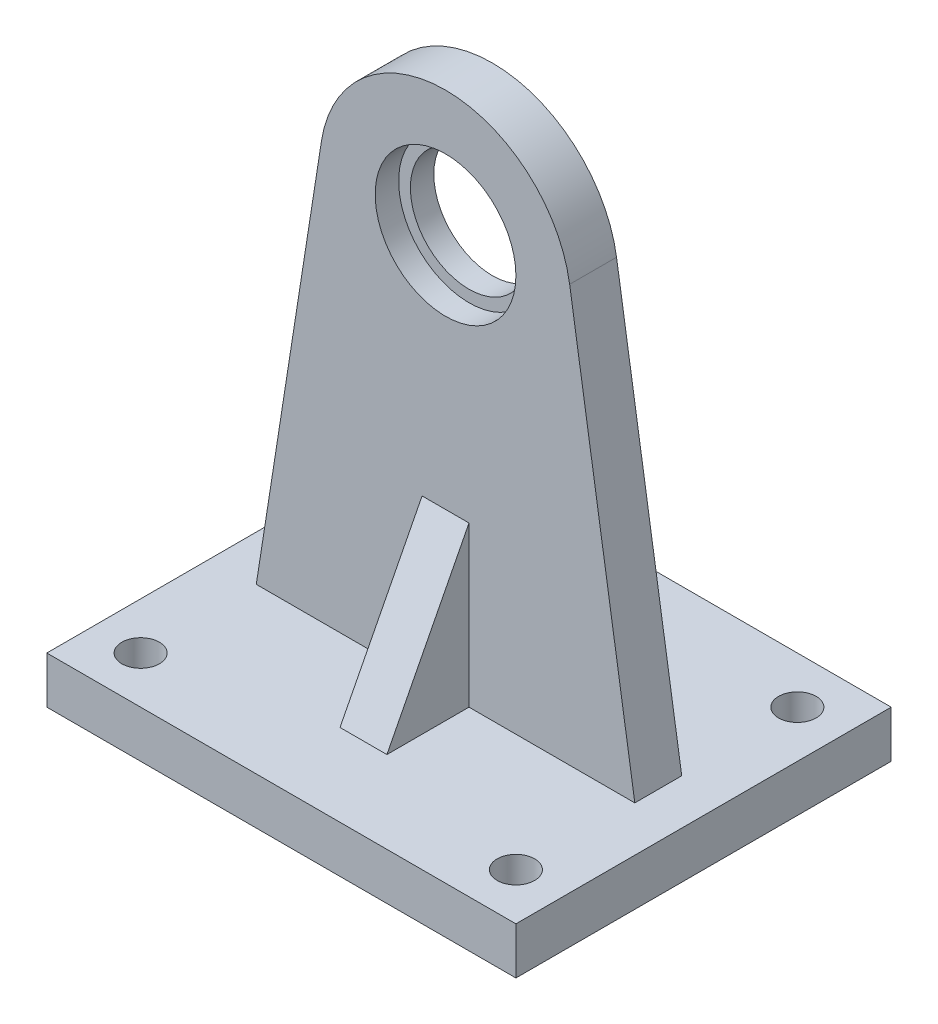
ISO-10303-21;
HEADER;
FILE_DESCRIPTION(('STEP AP214'),'2;1');
FILE_NAME('part.step','',(''),(''),'','','');
FILE_SCHEMA(('AUTOMOTIVE_DESIGN { 1 0 10303 214 1 1 1 1 }'));
ENDSEC;
DATA;
#1=APPLICATION_CONTEXT('core data for automotive mechanical design processes');
#2=APPLICATION_PROTOCOL_DEFINITION('international standard','automotive_design',2000,#1);
#3=PRODUCT_CONTEXT('',#1,'mechanical');
#4=PRODUCT('Part','Part','',(#3));
#5=PRODUCT_RELATED_PRODUCT_CATEGORY('part','',(#4));
#6=PRODUCT_DEFINITION_FORMATION('','',#4);
#7=PRODUCT_DEFINITION_CONTEXT('part definition',#1,'design');
#8=PRODUCT_DEFINITION('design','',#6,#7);
#9=PRODUCT_DEFINITION_SHAPE('','',#8);
#10=(LENGTH_UNIT() NAMED_UNIT(*) SI_UNIT(.MILLI.,.METRE.));
#11=(NAMED_UNIT(*) PLANE_ANGLE_UNIT() SI_UNIT($,.RADIAN.));
#12=(NAMED_UNIT(*) SI_UNIT($,.STERADIAN.) SOLID_ANGLE_UNIT());
#13=UNCERTAINTY_MEASURE_WITH_UNIT(LENGTH_MEASURE(1.E-05),#10,'distance_accuracy_value','');
#14=(GEOMETRIC_REPRESENTATION_CONTEXT(3) GLOBAL_UNCERTAINTY_ASSIGNED_CONTEXT((#13)) GLOBAL_UNIT_ASSIGNED_CONTEXT((#10,
#11,#12)) REPRESENTATION_CONTEXT('',''));
#15=CARTESIAN_POINT('',(0.,0.,0.));
#16=DIRECTION('',(0.,0.,1.));
#17=DIRECTION('',(1.,0.,0.));
#18=AXIS2_PLACEMENT_3D('',#15,#16,#17);
#19=CARTESIAN_POINT('',(-31.75,6.35,25.4));
#20=DIRECTION('',(0.,1.,0.));
#21=DIRECTION('',(0.,0.,1.));
#22=AXIS2_PLACEMENT_3D('',#19,#20,#21);
#23=PLANE('',#22);
#24=CARTESIAN_POINT('',(-25.4,6.35,-19.05));
#25=DIRECTION('',(0.,1.,0.));
#26=DIRECTION('',(0.,0.,-1.));
#27=AXIS2_PLACEMENT_3D('',#24,#25,#26);
#28=CIRCLE('',#27,2.54);
#29=CARTESIAN_POINT('',(-25.4,6.35,-21.59));
#30=VERTEX_POINT('',#29);
#31=EDGE_CURVE('E395',#30,#30,#28,.T.);
#32=ORIENTED_EDGE('',*,*,#31,.F.);
#33=EDGE_LOOP('',(#32));
#34=FACE_BOUND('',#33,.T.);
#35=CARTESIAN_POINT('',(25.4,6.35,-19.05));
#36=DIRECTION('',(0.,1.,0.));
#37=DIRECTION('',(0.,0.,1.));
#38=AXIS2_PLACEMENT_3D('',#35,#36,#37);
#39=CIRCLE('',#38,2.54);
#40=CARTESIAN_POINT('',(25.4,6.35,-16.51));
#41=VERTEX_POINT('',#40);
#42=EDGE_CURVE('E397',#41,#41,#39,.T.);
#43=ORIENTED_EDGE('',*,*,#42,.F.);
#44=EDGE_LOOP('',(#43));
#45=FACE_BOUND('',#44,.T.);
#46=CARTESIAN_POINT('',(25.4,6.35,19.05));
#47=DIRECTION('',(0.,1.,0.));
#48=DIRECTION('',(0.,0.,-1.));
#49=AXIS2_PLACEMENT_3D('',#46,#47,#48);
#50=CIRCLE('',#49,2.54);
#51=CARTESIAN_POINT('',(25.4,6.35,16.51));
#52=VERTEX_POINT('',#51);
#53=EDGE_CURVE('E403',#52,#52,#50,.T.);
#54=ORIENTED_EDGE('',*,*,#53,.F.);
#55=EDGE_LOOP('',(#54));
#56=FACE_BOUND('',#55,.T.);
#57=CARTESIAN_POINT('',(-25.4,6.35,19.05));
#58=DIRECTION('',(0.,1.,0.));
#59=DIRECTION('',(0.,0.,1.));
#60=AXIS2_PLACEMENT_3D('',#57,#58,#59);
#61=CIRCLE('',#60,2.54);
#62=CARTESIAN_POINT('',(-25.4,6.35,21.59));
#63=VERTEX_POINT('',#62);
#64=EDGE_CURVE('E335',#63,#63,#61,.T.);
#65=ORIENTED_EDGE('',*,*,#64,.F.);
#66=EDGE_LOOP('',(#65));
#67=FACE_BOUND('',#66,.T.);
#68=DIRECTION('',(0.,0.,-1.));
#69=VECTOR('',#68,1.);
#70=CARTESIAN_POINT('',(3.175,6.35,14.2875));
#71=LINE('',#70,#69);
#72=CARTESIAN_POINT('',(3.175,6.35,14.2875));
#73=VERTEX_POINT('',#72);
#74=CARTESIAN_POINT('',(3.175,6.35,3.175));
#75=VERTEX_POINT('',#74);
#76=EDGE_CURVE('E46',#73,#75,#71,.T.);
#77=ORIENTED_EDGE('',*,*,#76,.F.);
#78=DIRECTION('',(-1.,0.,0.));
#79=VECTOR('',#78,1.);
#80=CARTESIAN_POINT('',(3.175,6.35,14.2875));
#81=LINE('',#80,#79);
#82=CARTESIAN_POINT('',(-3.175,6.35,14.2875));
#83=VERTEX_POINT('',#82);
#84=EDGE_CURVE('E51',#73,#83,#81,.T.);
#85=ORIENTED_EDGE('',*,*,#84,.T.);
#86=DIRECTION('',(0.,0.,-1.));
#87=VECTOR('',#86,1.);
#88=CARTESIAN_POINT('',(-3.175,6.35,14.2875));
#89=LINE('',#88,#87);
#90=CARTESIAN_POINT('',(-3.175,6.35,3.175));
#91=VERTEX_POINT('',#90);
#92=EDGE_CURVE('E141',#83,#91,#89,.T.);
#93=ORIENTED_EDGE('',*,*,#92,.T.);
#94=DIRECTION('',(1.,0.,0.));
#95=VECTOR('',#94,1.);
#96=CARTESIAN_POINT('',(-25.6206779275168,6.35,3.175));
#97=LINE('',#96,#95);
#98=CARTESIAN_POINT('',(-25.6206779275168,6.35,3.175));
#99=VERTEX_POINT('',#98);
#100=EDGE_CURVE('E188',#99,#91,#97,.T.);
#101=ORIENTED_EDGE('',*,*,#100,.F.);
#102=DIRECTION('',(0.,0.,-1.));
#103=VECTOR('',#102,1.);
#104=CARTESIAN_POINT('',(-25.6206779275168,6.35,3.175));
#105=LINE('',#104,#103);
#106=CARTESIAN_POINT('',(-25.6206779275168,6.35,-3.175));
#107=VERTEX_POINT('',#106);
#108=EDGE_CURVE('E197',#99,#107,#105,.T.);
#109=ORIENTED_EDGE('',*,*,#108,.T.);
#110=DIRECTION('',(1.,0.,0.));
#111=VECTOR('',#110,1.);
#112=CARTESIAN_POINT('',(-25.6206779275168,6.35,-3.175));
#113=LINE('',#112,#111);
#114=CARTESIAN_POINT('',(-3.175,6.35,-3.175));
#115=VERTEX_POINT('',#114);
#116=EDGE_CURVE('E155',#107,#115,#113,.T.);
#117=ORIENTED_EDGE('',*,*,#116,.T.);
#118=CARTESIAN_POINT('',(-3.175,6.35,-14.2875));
#119=VERTEX_POINT('',#118);
#120=EDGE_CURVE('E135',#115,#119,#89,.T.);
#121=ORIENTED_EDGE('',*,*,#120,.T.);
#122=DIRECTION('',(-1.,0.,0.));
#123=VECTOR('',#122,1.);
#124=CARTESIAN_POINT('',(3.175,6.35,-14.2875));
#125=LINE('',#124,#123);
#126=CARTESIAN_POINT('',(3.175,6.35,-14.2875));
#127=VERTEX_POINT('',#126);
#128=EDGE_CURVE('E145',#127,#119,#125,.T.);
#129=ORIENTED_EDGE('',*,*,#128,.F.);
#130=CARTESIAN_POINT('',(3.175,6.35,-3.175));
#131=VERTEX_POINT('',#130);
#132=EDGE_CURVE('E164',#131,#127,#71,.T.);
#133=ORIENTED_EDGE('',*,*,#132,.F.);
#134=CARTESIAN_POINT('',(25.6206779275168,6.35,-3.175));
#135=VERTEX_POINT('',#134);
#136=EDGE_CURVE('E178',#131,#135,#113,.T.);
#137=ORIENTED_EDGE('',*,*,#136,.T.);
#138=DIRECTION('',(0.,0.,-1.));
#139=VECTOR('',#138,1.);
#140=CARTESIAN_POINT('',(25.6206779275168,6.35,3.175));
#141=LINE('',#140,#139);
#142=CARTESIAN_POINT('',(25.6206779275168,6.35,3.175));
#143=VERTEX_POINT('',#142);
#144=EDGE_CURVE('E205',#143,#135,#141,.T.);
#145=ORIENTED_EDGE('',*,*,#144,.F.);
#146=EDGE_CURVE('E187',#75,#143,#97,.T.);
#147=ORIENTED_EDGE('',*,*,#146,.F.);
#148=EDGE_LOOP('',(#77,#85,#93,#101,#109,#117,#121,#129,#133,#137,#145,#147));
#149=FACE_BOUND('',#148,.T.);
#150=DIRECTION('',(0.,0.,1.));
#151=VECTOR('',#150,1.);
#152=CARTESIAN_POINT('',(-31.75,6.35,-25.4));
#153=LINE('',#152,#151);
#154=CARTESIAN_POINT('',(-31.75,6.35,-25.4));
#155=VERTEX_POINT('',#154);
#156=CARTESIAN_POINT('',(-31.75,6.35,25.4));
#157=VERTEX_POINT('',#156);
#158=EDGE_CURVE('E217',#155,#157,#153,.T.);
#159=ORIENTED_EDGE('',*,*,#158,.T.);
#160=DIRECTION('',(1.,0.,0.));
#161=VECTOR('',#160,1.);
#162=CARTESIAN_POINT('',(-31.75,6.35,25.4));
#163=LINE('',#162,#161);
#164=CARTESIAN_POINT('',(31.75,6.35,25.4));
#165=VERTEX_POINT('',#164);
#166=EDGE_CURVE('E220',#157,#165,#163,.T.);
#167=ORIENTED_EDGE('',*,*,#166,.T.);
#168=DIRECTION('',(0.,0.,-1.));
#169=VECTOR('',#168,1.);
#170=CARTESIAN_POINT('',(31.75,6.35,-25.4));
#171=LINE('',#170,#169);
#172=CARTESIAN_POINT('',(31.75,6.35,-25.4));
#173=VERTEX_POINT('',#172);
#174=EDGE_CURVE('E222',#165,#173,#171,.T.);
#175=ORIENTED_EDGE('',*,*,#174,.T.);
#176=DIRECTION('',(-1.,0.,0.));
#177=VECTOR('',#176,1.);
#178=CARTESIAN_POINT('',(-31.75,6.35,-25.4));
#179=LINE('',#178,#177);
#180=EDGE_CURVE('E224',#173,#155,#179,.T.);
#181=ORIENTED_EDGE('',*,*,#180,.T.);
#182=EDGE_LOOP('',(#159,#167,#175,#181));
#183=FACE_BOUND('',#182,.T.);
#184=ADVANCED_FACE('F31',(#34,#45,#56,#67,#149,#183),#23,.T.);
#185=CARTESIAN_POINT('',(-31.75,6.35,-25.4));
#186=DIRECTION('',(1.,0.,0.));
#187=DIRECTION('',(0.,0.,-1.));
#188=AXIS2_PLACEMENT_3D('',#185,#186,#187);
#189=PLANE('',#188);
#190=DIRECTION('',(0.,0.,1.));
#191=VECTOR('',#190,1.);
#192=CARTESIAN_POINT('',(-31.75,0.,-25.4));
#193=LINE('',#192,#191);
#194=CARTESIAN_POINT('',(-31.75,0.,-25.4));
#195=VERTEX_POINT('',#194);
#196=CARTESIAN_POINT('',(-31.75,0.,25.4));
#197=VERTEX_POINT('',#196);
#198=EDGE_CURVE('E208',#195,#197,#193,.T.);
#199=ORIENTED_EDGE('',*,*,#198,.T.);
#200=DIRECTION('',(0.,-1.,0.));
#201=VECTOR('',#200,1.);
#202=CARTESIAN_POINT('',(-31.75,6.35,25.4));
#203=LINE('',#202,#201);
#204=EDGE_CURVE('E235',#157,#197,#203,.T.);
#205=ORIENTED_EDGE('',*,*,#204,.F.);
#206=ORIENTED_EDGE('',*,*,#158,.F.);
#207=DIRECTION('',(0.,-1.,0.));
#208=VECTOR('',#207,1.);
#209=CARTESIAN_POINT('',(-31.75,6.35,-25.4));
#210=LINE('',#209,#208);
#211=EDGE_CURVE('E226',#155,#195,#210,.T.);
#212=ORIENTED_EDGE('',*,*,#211,.T.);
#213=EDGE_LOOP('',(#199,#205,#206,#212));
#214=FACE_BOUND('',#213,.T.);
#215=ADVANCED_FACE('F33',(#214),#189,.F.);
#216=CARTESIAN_POINT('',(-31.75,6.35,25.4));
#217=DIRECTION('',(0.,0.,-1.));
#218=DIRECTION('',(-1.,0.,0.));
#219=AXIS2_PLACEMENT_3D('',#216,#217,#218);
#220=PLANE('',#219);
#221=DIRECTION('',(1.,0.,0.));
#222=VECTOR('',#221,1.);
#223=CARTESIAN_POINT('',(-31.75,0.,25.4));
#224=LINE('',#223,#222);
#225=CARTESIAN_POINT('',(31.75,0.,25.4));
#226=VERTEX_POINT('',#225);
#227=EDGE_CURVE('E211',#197,#226,#224,.T.);
#228=ORIENTED_EDGE('',*,*,#227,.T.);
#229=DIRECTION('',(0.,-1.,0.));
#230=VECTOR('',#229,1.);
#231=CARTESIAN_POINT('',(31.75,6.35,25.4));
#232=LINE('',#231,#230);
#233=EDGE_CURVE('E232',#165,#226,#232,.T.);
#234=ORIENTED_EDGE('',*,*,#233,.F.);
#235=ORIENTED_EDGE('',*,*,#166,.F.);
#236=ORIENTED_EDGE('',*,*,#204,.T.);
#237=EDGE_LOOP('',(#228,#234,#235,#236));
#238=FACE_BOUND('',#237,.T.);
#239=ADVANCED_FACE('F286',(#238),#220,.F.);
#240=CARTESIAN_POINT('',(31.75,6.35,-25.4));
#241=DIRECTION('',(-1.,0.,0.));
#242=DIRECTION('',(0.,0.,1.));
#243=AXIS2_PLACEMENT_3D('',#240,#241,#242);
#244=PLANE('',#243);
#245=DIRECTION('',(0.,0.,-1.));
#246=VECTOR('',#245,1.);
#247=CARTESIAN_POINT('',(31.75,0.,-25.4));
#248=LINE('',#247,#246);
#249=CARTESIAN_POINT('',(31.75,0.,-25.4));
#250=VERTEX_POINT('',#249);
#251=EDGE_CURVE('E213',#226,#250,#248,.T.);
#252=ORIENTED_EDGE('',*,*,#251,.T.);
#253=DIRECTION('',(0.,-1.,0.));
#254=VECTOR('',#253,1.);
#255=CARTESIAN_POINT('',(31.75,6.35,-25.4));
#256=LINE('',#255,#254);
#257=EDGE_CURVE('E229',#173,#250,#256,.T.);
#258=ORIENTED_EDGE('',*,*,#257,.F.);
#259=ORIENTED_EDGE('',*,*,#174,.F.);
#260=ORIENTED_EDGE('',*,*,#233,.T.);
#261=EDGE_LOOP('',(#252,#258,#259,#260));
#262=FACE_BOUND('',#261,.T.);
#263=ADVANCED_FACE('F295',(#262),#244,.F.);
#264=CARTESIAN_POINT('',(-31.75,6.35,-25.4));
#265=DIRECTION('',(0.,0.,1.));
#266=DIRECTION('',(1.,0.,0.));
#267=AXIS2_PLACEMENT_3D('',#264,#265,#266);
#268=PLANE('',#267);
#269=DIRECTION('',(-1.,0.,0.));
#270=VECTOR('',#269,1.);
#271=CARTESIAN_POINT('',(-31.75,0.,-25.4));
#272=LINE('',#271,#270);
#273=EDGE_CURVE('E215',#250,#195,#272,.T.);
#274=ORIENTED_EDGE('',*,*,#273,.T.);
#275=ORIENTED_EDGE('',*,*,#211,.F.);
#276=ORIENTED_EDGE('',*,*,#180,.F.);
#277=ORIENTED_EDGE('',*,*,#257,.T.);
#278=EDGE_LOOP('',(#274,#275,#276,#277));
#279=FACE_BOUND('',#278,.T.);
#280=ADVANCED_FACE('F292',(#279),#268,.F.);
#281=CARTESIAN_POINT('',(-31.75,0.,25.4));
#282=DIRECTION('',(0.,1.,0.));
#283=DIRECTION('',(0.,0.,1.));
#284=AXIS2_PLACEMENT_3D('',#281,#282,#283);
#285=PLANE('',#284);
#286=CARTESIAN_POINT('',(-25.4,0.,-19.05));
#287=DIRECTION('',(0.,1.,0.));
#288=DIRECTION('',(0.,0.,-1.));
#289=AXIS2_PLACEMENT_3D('',#286,#287,#288);
#290=CIRCLE('',#289,2.54);
#291=CARTESIAN_POINT('',(-25.4,0.,-21.59));
#292=VERTEX_POINT('',#291);
#293=EDGE_CURVE('E321',#292,#292,#290,.T.);
#294=ORIENTED_EDGE('',*,*,#293,.T.);
#295=EDGE_LOOP('',(#294));
#296=FACE_BOUND('',#295,.T.);
#297=CARTESIAN_POINT('',(25.4,0.,-19.05));
#298=DIRECTION('',(0.,1.,0.));
#299=DIRECTION('',(0.,0.,1.));
#300=AXIS2_PLACEMENT_3D('',#297,#298,#299);
#301=CIRCLE('',#300,2.54);
#302=CARTESIAN_POINT('',(25.4,0.,-16.51));
#303=VERTEX_POINT('',#302);
#304=EDGE_CURVE('E325',#303,#303,#301,.T.);
#305=ORIENTED_EDGE('',*,*,#304,.T.);
#306=EDGE_LOOP('',(#305));
#307=FACE_BOUND('',#306,.T.);
#308=CARTESIAN_POINT('',(25.4,0.,19.05));
#309=DIRECTION('',(0.,1.,0.));
#310=DIRECTION('',(0.,0.,-1.));
#311=AXIS2_PLACEMENT_3D('',#308,#309,#310);
#312=CIRCLE('',#311,2.54);
#313=CARTESIAN_POINT('',(25.4,0.,16.51));
#314=VERTEX_POINT('',#313);
#315=EDGE_CURVE('E329',#314,#314,#312,.T.);
#316=ORIENTED_EDGE('',*,*,#315,.T.);
#317=EDGE_LOOP('',(#316));
#318=FACE_BOUND('',#317,.T.);
#319=CARTESIAN_POINT('',(-25.4,0.,19.05));
#320=DIRECTION('',(0.,1.,0.));
#321=DIRECTION('',(0.,0.,1.));
#322=AXIS2_PLACEMENT_3D('',#319,#320,#321);
#323=CIRCLE('',#322,2.54);
#324=CARTESIAN_POINT('',(-25.4,0.,21.59));
#325=VERTEX_POINT('',#324);
#326=EDGE_CURVE('E332',#325,#325,#323,.T.);
#327=ORIENTED_EDGE('',*,*,#326,.T.);
#328=EDGE_LOOP('',(#327));
#329=FACE_BOUND('',#328,.T.);
#330=ORIENTED_EDGE('',*,*,#198,.F.);
#331=ORIENTED_EDGE('',*,*,#273,.F.);
#332=ORIENTED_EDGE('',*,*,#251,.F.);
#333=ORIENTED_EDGE('',*,*,#227,.F.);
#334=EDGE_LOOP('',(#330,#331,#332,#333));
#335=FACE_BOUND('',#334,.T.);
#336=ADVANCED_FACE('F278',(#296,#307,#318,#329,#335),#285,.F.);
#337=CARTESIAN_POINT('',(25.6206779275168,6.35,3.175));
#338=DIRECTION('',(-0.987975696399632,-0.154609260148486,0.));
#339=DIRECTION('',(0.154609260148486,-0.987975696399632,0.));
#340=AXIS2_PLACEMENT_3D('',#337,#338,#339);
#341=PLANE('',#340);
#342=DIRECTION('',(-0.154609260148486,0.987975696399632,0.));
#343=VECTOR('',#342,1.);
#344=CARTESIAN_POINT('',(25.6206779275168,6.35,-3.175));
#345=LINE('',#344,#343);
#346=CARTESIAN_POINT('',(16.7976630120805,62.7303506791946,-3.175));
#347=VERTEX_POINT('',#346);
#348=EDGE_CURVE('E180',#135,#347,#345,.T.);
#349=ORIENTED_EDGE('',*,*,#348,.T.);
#350=DIRECTION('',(0.,0.,-1.));
#351=VECTOR('',#350,1.);
#352=CARTESIAN_POINT('',(16.7976630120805,62.7303506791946,3.175));
#353=LINE('',#352,#351);
#354=CARTESIAN_POINT('',(16.7976630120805,62.7303506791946,3.175));
#355=VERTEX_POINT('',#354);
#356=EDGE_CURVE('E202',#355,#347,#353,.T.);
#357=ORIENTED_EDGE('',*,*,#356,.F.);
#358=DIRECTION('',(-0.154609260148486,0.987975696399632,0.));
#359=VECTOR('',#358,1.);
#360=CARTESIAN_POINT('',(25.6206779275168,6.35,3.175));
#361=LINE('',#360,#359);
#362=EDGE_CURVE('E190',#143,#355,#361,.T.);
#363=ORIENTED_EDGE('',*,*,#362,.F.);
#364=ORIENTED_EDGE('',*,*,#144,.T.);
#365=EDGE_LOOP('',(#349,#357,#363,#364));
#366=FACE_BOUND('',#365,.T.);
#367=ADVANCED_FACE('F250',(#366),#341,.F.);
#368=CARTESIAN_POINT('',(0.,60.1016683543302,3.175));
#369=DIRECTION('',(0.,0.,-1.));
#370=DIRECTION('',(-1.,0.,0.));
#371=AXIS2_PLACEMENT_3D('',#368,#369,#370);
#372=CYLINDRICAL_SURFACE('',#371,17.0021014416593);
#373=CARTESIAN_POINT('',(0.,60.1016683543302,-3.175));
#374=DIRECTION('',(0.,0.,1.));
#375=DIRECTION('',(-1.,0.,0.));
#376=AXIS2_PLACEMENT_3D('',#373,#374,#375);
#377=CIRCLE('',#376,17.0021014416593);
#378=CARTESIAN_POINT('',(-16.7976630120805,62.7303506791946,-3.175));
#379=VERTEX_POINT('',#378);
#380=EDGE_CURVE('E182',#347,#379,#377,.T.);
#381=ORIENTED_EDGE('',*,*,#380,.T.);
#382=DIRECTION('',(0.,0.,-1.));
#383=VECTOR('',#382,1.);
#384=CARTESIAN_POINT('',(-16.7976630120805,62.7303506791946,3.175));
#385=LINE('',#384,#383);
#386=CARTESIAN_POINT('',(-16.7976630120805,62.7303506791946,3.175));
#387=VERTEX_POINT('',#386);
#388=EDGE_CURVE('E199',#387,#379,#385,.T.);
#389=ORIENTED_EDGE('',*,*,#388,.F.);
#390=CARTESIAN_POINT('',(0.,60.1016683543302,3.175));
#391=DIRECTION('',(0.,0.,1.));
#392=DIRECTION('',(-1.,0.,0.));
#393=AXIS2_PLACEMENT_3D('',#390,#391,#392);
#394=CIRCLE('',#393,17.0021014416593);
#395=EDGE_CURVE('E192',#355,#387,#394,.T.);
#396=ORIENTED_EDGE('',*,*,#395,.F.);
#397=ORIENTED_EDGE('',*,*,#356,.T.);
#398=EDGE_LOOP('',(#381,#389,#396,#397));
#399=FACE_BOUND('',#398,.T.);
#400=ADVANCED_FACE('F270',(#399),#372,.T.);
#401=CARTESIAN_POINT('',(-25.6206779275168,6.35,3.175));
#402=DIRECTION('',(0.987975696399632,-0.154609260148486,0.));
#403=DIRECTION('',(0.154609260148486,0.987975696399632,0.));
#404=AXIS2_PLACEMENT_3D('',#401,#402,#403);
#405=PLANE('',#404);
#406=DIRECTION('',(-0.154609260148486,-0.987975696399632,0.));
#407=VECTOR('',#406,1.);
#408=CARTESIAN_POINT('',(-25.6206779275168,6.35,-3.175));
#409=LINE('',#408,#407);
#410=EDGE_CURVE('E184',#379,#107,#409,.T.);
#411=ORIENTED_EDGE('',*,*,#410,.T.);
#412=ORIENTED_EDGE('',*,*,#108,.F.);
#413=DIRECTION('',(-0.154609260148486,-0.987975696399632,0.));
#414=VECTOR('',#413,1.);
#415=CARTESIAN_POINT('',(-25.6206779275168,6.35,3.175));
#416=LINE('',#415,#414);
#417=EDGE_CURVE('E194',#387,#99,#416,.T.);
#418=ORIENTED_EDGE('',*,*,#417,.F.);
#419=ORIENTED_EDGE('',*,*,#388,.T.);
#420=EDGE_LOOP('',(#411,#412,#418,#419));
#421=FACE_BOUND('',#420,.T.);
#422=ADVANCED_FACE('F268',(#421),#405,.F.);
#423=CARTESIAN_POINT('',(0.,60.1016683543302,3.175));
#424=DIRECTION('',(0.,0.,-1.));
#425=DIRECTION('',(-1.,0.,0.));
#426=AXIS2_PLACEMENT_3D('',#423,#424,#425);
#427=PLANE('',#426);
#428=CARTESIAN_POINT('',(0.,60.1016683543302,3.175));
#429=DIRECTION('',(0.,0.,1.));
#430=DIRECTION('',(1.,0.,0.));
#431=AXIS2_PLACEMENT_3D('',#428,#429,#430);
#432=CIRCLE('',#431,9.525);
#433=CARTESIAN_POINT('',(9.525,60.1016683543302,3.175));
#434=VERTEX_POINT('',#433);
#435=EDGE_CURVE('E159',#434,#434,#432,.T.);
#436=ORIENTED_EDGE('',*,*,#435,.F.);
#437=EDGE_LOOP('',(#436));
#438=FACE_BOUND('',#437,.T.);
#439=DIRECTION('',(-1.,0.,0.));
#440=VECTOR('',#439,1.);
#441=CARTESIAN_POINT('',(3.175,27.94,3.175));
#442=LINE('',#441,#440);
#443=CARTESIAN_POINT('',(3.175,27.94,3.175));
#444=VERTEX_POINT('',#443);
#445=CARTESIAN_POINT('',(-3.175,27.94,3.175));
#446=VERTEX_POINT('',#445);
#447=EDGE_CURVE('E170',#444,#446,#442,.T.);
#448=ORIENTED_EDGE('',*,*,#447,.F.);
#449=DIRECTION('',(0.,-1.,0.));
#450=VECTOR('',#449,1.);
#451=CARTESIAN_POINT('',(3.175,60.1016683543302,3.175));
#452=LINE('',#451,#450);
#453=EDGE_CURVE('E176',#444,#75,#452,.T.);
#454=ORIENTED_EDGE('',*,*,#453,.T.);
#455=ORIENTED_EDGE('',*,*,#146,.T.);
#456=ORIENTED_EDGE('',*,*,#362,.T.);
#457=ORIENTED_EDGE('',*,*,#395,.T.);
#458=ORIENTED_EDGE('',*,*,#417,.T.);
#459=ORIENTED_EDGE('',*,*,#100,.T.);
#460=DIRECTION('',(0.,-1.,0.));
#461=VECTOR('',#460,1.);
#462=CARTESIAN_POINT('',(-3.175,60.1016683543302,3.175));
#463=LINE('',#462,#461);
#464=EDGE_CURVE('E149',#446,#91,#463,.T.);
#465=ORIENTED_EDGE('',*,*,#464,.F.);
#466=EDGE_LOOP('',(#448,#454,#455,#456,#457,#458,#459,#465));
#467=FACE_BOUND('',#466,.T.);
#468=ADVANCED_FACE('F253',(#438,#467),#427,.F.);
#469=CARTESIAN_POINT('',(0.,60.1016683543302,-3.175));
#470=DIRECTION('',(0.,0.,-1.));
#471=DIRECTION('',(-1.,0.,0.));
#472=AXIS2_PLACEMENT_3D('',#469,#470,#471);
#473=PLANE('',#472);
#474=CARTESIAN_POINT('',(0.,60.1016683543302,-3.175));
#475=DIRECTION('',(0.,0.,-1.));
#476=DIRECTION('',(-1.,0.,0.));
#477=AXIS2_PLACEMENT_3D('',#474,#475,#476);
#478=CIRCLE('',#477,7.9375);
#479=CARTESIAN_POINT('',(-7.9375,60.1016683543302,-3.175));
#480=VERTEX_POINT('',#479);
#481=EDGE_CURVE('E338',#480,#480,#478,.T.);
#482=ORIENTED_EDGE('',*,*,#481,.F.);
#483=EDGE_LOOP('',(#482));
#484=FACE_BOUND('',#483,.T.);
#485=DIRECTION('',(0.,-1.,0.));
#486=VECTOR('',#485,1.);
#487=CARTESIAN_POINT('',(3.175,60.1016683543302,-3.175));
#488=LINE('',#487,#486);
#489=CARTESIAN_POINT('',(3.175,27.94,-3.175));
#490=VERTEX_POINT('',#489);
#491=EDGE_CURVE('E11',#490,#131,#488,.T.);
#492=ORIENTED_EDGE('',*,*,#491,.F.);
#493=DIRECTION('',(-1.,0.,0.));
#494=VECTOR('',#493,1.);
#495=CARTESIAN_POINT('',(3.175,27.94,-3.175));
#496=LINE('',#495,#494);
#497=CARTESIAN_POINT('',(-3.175,27.94,-3.175));
#498=VERTEX_POINT('',#497);
#499=EDGE_CURVE('E150',#490,#498,#496,.T.);
#500=ORIENTED_EDGE('',*,*,#499,.T.);
#501=DIRECTION('',(0.,-1.,0.));
#502=VECTOR('',#501,1.);
#503=CARTESIAN_POINT('',(-3.175,60.1016683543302,-3.175));
#504=LINE('',#503,#502);
#505=EDGE_CURVE('E39',#498,#115,#504,.T.);
#506=ORIENTED_EDGE('',*,*,#505,.T.);
#507=ORIENTED_EDGE('',*,*,#116,.F.);
#508=ORIENTED_EDGE('',*,*,#410,.F.);
#509=ORIENTED_EDGE('',*,*,#380,.F.);
#510=ORIENTED_EDGE('',*,*,#348,.F.);
#511=ORIENTED_EDGE('',*,*,#136,.F.);
#512=EDGE_LOOP('',(#492,#500,#506,#507,#508,#509,#510,#511));
#513=FACE_BOUND('',#512,.T.);
#514=ADVANCED_FACE('F239',(#484,#513),#473,.T.);
#515=CARTESIAN_POINT('',(3.175,6.35,-14.2875));
#516=DIRECTION('',(1.,0.,0.));
#517=DIRECTION('',(0.,0.,-1.));
#518=AXIS2_PLACEMENT_3D('',#515,#516,#517);
#519=PLANE('',#518);
#520=DIRECTION('',(0.,0.889135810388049,0.457643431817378));
#521=VECTOR('',#520,1.);
#522=CARTESIAN_POINT('',(3.175,6.35,-14.2875));
#523=LINE('',#522,#521);
#524=EDGE_CURVE('E147',#127,#490,#523,.T.);
#525=ORIENTED_EDGE('',*,*,#524,.T.);
#526=ORIENTED_EDGE('',*,*,#491,.T.);
#527=ORIENTED_EDGE('',*,*,#132,.T.);
#528=EDGE_LOOP('',(#525,#526,#527));
#529=FACE_BOUND('',#528,.T.);
#530=ADVANCED_FACE('F244',(#529),#519,.T.);
#531=CARTESIAN_POINT('',(-3.175,6.35,-14.2875));
#532=DIRECTION('',(1.,0.,0.));
#533=DIRECTION('',(0.,0.,-1.));
#534=AXIS2_PLACEMENT_3D('',#531,#532,#533);
#535=PLANE('',#534);
#536=ORIENTED_EDGE('',*,*,#505,.F.);
#537=DIRECTION('',(0.,0.889135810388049,0.457643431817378));
#538=VECTOR('',#537,1.);
#539=CARTESIAN_POINT('',(-3.175,6.35,-14.2875));
#540=LINE('',#539,#538);
#541=EDGE_CURVE('E131',#119,#498,#540,.T.);
#542=ORIENTED_EDGE('',*,*,#541,.F.);
#543=ORIENTED_EDGE('',*,*,#120,.F.);
#544=EDGE_LOOP('',(#536,#542,#543));
#545=FACE_BOUND('',#544,.T.);
#546=ADVANCED_FACE('F133',(#545),#535,.F.);
#547=CARTESIAN_POINT('',(3.175,6.35,-14.2875));
#548=DIRECTION('',(0.,-0.457643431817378,0.889135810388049));
#549=DIRECTION('',(0.,-0.889135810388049,-0.457643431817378));
#550=AXIS2_PLACEMENT_3D('',#547,#548,#549);
#551=PLANE('',#550);
#552=ORIENTED_EDGE('',*,*,#541,.T.);
#553=ORIENTED_EDGE('',*,*,#499,.F.);
#554=ORIENTED_EDGE('',*,*,#524,.F.);
#555=ORIENTED_EDGE('',*,*,#128,.T.);
#556=EDGE_LOOP('',(#552,#553,#554,#555));
#557=FACE_BOUND('',#556,.T.);
#558=ADVANCED_FACE('F146',(#557),#551,.F.);
#559=ORIENTED_EDGE('',*,*,#453,.F.);
#560=DIRECTION('',(0.,-0.889135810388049,0.457643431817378));
#561=VECTOR('',#560,1.);
#562=CARTESIAN_POINT('',(3.175,6.35,14.2875));
#563=LINE('',#562,#561);
#564=EDGE_CURVE('E167',#444,#73,#563,.T.);
#565=ORIENTED_EDGE('',*,*,#564,.T.);
#566=ORIENTED_EDGE('',*,*,#76,.T.);
#567=EDGE_LOOP('',(#559,#565,#566));
#568=FACE_BOUND('',#567,.T.);
#569=ADVANCED_FACE('F257',(#568),#519,.T.);
#570=DIRECTION('',(0.,-0.889135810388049,0.457643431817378));
#571=VECTOR('',#570,1.);
#572=CARTESIAN_POINT('',(-3.175,6.35,14.2875));
#573=LINE('',#572,#571);
#574=EDGE_CURVE('E140',#446,#83,#573,.T.);
#575=ORIENTED_EDGE('',*,*,#574,.F.);
#576=ORIENTED_EDGE('',*,*,#464,.T.);
#577=ORIENTED_EDGE('',*,*,#92,.F.);
#578=EDGE_LOOP('',(#575,#576,#577));
#579=FACE_BOUND('',#578,.T.);
#580=ADVANCED_FACE('F264',(#579),#535,.F.);
#581=CARTESIAN_POINT('',(3.175,6.35,14.2875));
#582=DIRECTION('',(0.,-0.457643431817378,-0.889135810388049));
#583=DIRECTION('',(0.,0.889135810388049,-0.457643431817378));
#584=AXIS2_PLACEMENT_3D('',#581,#582,#583);
#585=PLANE('',#584);
#586=ORIENTED_EDGE('',*,*,#574,.T.);
#587=ORIENTED_EDGE('',*,*,#84,.F.);
#588=ORIENTED_EDGE('',*,*,#564,.F.);
#589=ORIENTED_EDGE('',*,*,#447,.T.);
#590=EDGE_LOOP('',(#586,#587,#588,#589));
#591=FACE_BOUND('',#590,.T.);
#592=ADVANCED_FACE('F260',(#591),#585,.F.);
#593=CARTESIAN_POINT('',(0.,60.1016683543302,0.));
#594=DIRECTION('',(0.,0.,1.));
#595=DIRECTION('',(1.,0.,0.));
#596=AXIS2_PLACEMENT_3D('',#593,#594,#595);
#597=CYLINDRICAL_SURFACE('',#596,9.525);
#598=CARTESIAN_POINT('',(0.,60.1016683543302,0.));
#599=DIRECTION('',(0.,0.,1.));
#600=DIRECTION('',(1.,0.,0.));
#601=AXIS2_PLACEMENT_3D('',#598,#599,#600);
#602=CIRCLE('',#601,9.525);
#603=CARTESIAN_POINT('',(9.525,60.1016683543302,0.));
#604=VERTEX_POINT('',#603);
#605=EDGE_CURVE('E156',#604,#604,#602,.T.);
#606=ORIENTED_EDGE('',*,*,#605,.F.);
#607=EDGE_LOOP('',(#606));
#608=FACE_BOUND('',#607,.T.);
#609=ORIENTED_EDGE('',*,*,#435,.T.);
#610=EDGE_LOOP('',(#609));
#611=FACE_BOUND('',#610,.T.);
#612=ADVANCED_FACE('F348',(#608,#611),#597,.F.);
#613=CARTESIAN_POINT('',(0.,60.1016683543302,0.));
#614=DIRECTION('',(0.,0.,1.));
#615=DIRECTION('',(1.,0.,0.));
#616=AXIS2_PLACEMENT_3D('',#613,#614,#615);
#617=PLANE('',#616);
#618=CARTESIAN_POINT('',(0.,60.1016683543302,0.));
#619=DIRECTION('',(0.,0.,1.));
#620=DIRECTION('',(1.,0.,0.));
#621=AXIS2_PLACEMENT_3D('',#618,#619,#620);
#622=CIRCLE('',#621,7.9375);
#623=CARTESIAN_POINT('',(7.9375,60.1016683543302,0.));
#624=VERTEX_POINT('',#623);
#625=EDGE_CURVE('E334',#624,#624,#622,.T.);
#626=ORIENTED_EDGE('',*,*,#625,.F.);
#627=EDGE_LOOP('',(#626));
#628=FACE_BOUND('',#627,.T.);
#629=ORIENTED_EDGE('',*,*,#605,.T.);
#630=EDGE_LOOP('',(#629));
#631=FACE_BOUND('',#630,.T.);
#632=ADVANCED_FACE('F368',(#628,#631),#617,.T.);
#633=CARTESIAN_POINT('',(0.,60.1016683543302,-25.4));
#634=DIRECTION('',(0.,0.,1.));
#635=DIRECTION('',(1.,0.,0.));
#636=AXIS2_PLACEMENT_3D('',#633,#634,#635);
#637=CYLINDRICAL_SURFACE('',#636,7.9375);
#638=ORIENTED_EDGE('',*,*,#481,.T.);
#639=EDGE_LOOP('',(#638));
#640=FACE_BOUND('',#639,.T.);
#641=ORIENTED_EDGE('',*,*,#625,.T.);
#642=EDGE_LOOP('',(#641));
#643=FACE_BOUND('',#642,.T.);
#644=ADVANCED_FACE('F372',(#640,#643),#637,.F.);
#645=CARTESIAN_POINT('',(-25.4,0.,19.05));
#646=DIRECTION('',(0.,1.,0.));
#647=DIRECTION('',(0.,0.,1.));
#648=AXIS2_PLACEMENT_3D('',#645,#646,#647);
#649=CYLINDRICAL_SURFACE('',#648,2.54);
#650=ORIENTED_EDGE('',*,*,#326,.F.);
#651=EDGE_LOOP('',(#650));
#652=FACE_BOUND('',#651,.T.);
#653=ORIENTED_EDGE('',*,*,#64,.T.);
#654=EDGE_LOOP('',(#653));
#655=FACE_BOUND('',#654,.T.);
#656=ADVANCED_FACE('F376',(#652,#655),#649,.F.);
#657=CARTESIAN_POINT('',(25.4,0.,19.05));
#658=DIRECTION('',(0.,1.,0.));
#659=DIRECTION('',(0.,0.,1.));
#660=AXIS2_PLACEMENT_3D('',#657,#658,#659);
#661=CYLINDRICAL_SURFACE('',#660,2.54);
#662=ORIENTED_EDGE('',*,*,#315,.F.);
#663=EDGE_LOOP('',(#662));
#664=FACE_BOUND('',#663,.T.);
#665=ORIENTED_EDGE('',*,*,#53,.T.);
#666=EDGE_LOOP('',(#665));
#667=FACE_BOUND('',#666,.T.);
#668=ADVANCED_FACE('F380',(#664,#667),#661,.F.);
#669=CARTESIAN_POINT('',(25.4,0.,-19.05));
#670=DIRECTION('',(0.,1.,0.));
#671=DIRECTION('',(0.,0.,1.));
#672=AXIS2_PLACEMENT_3D('',#669,#670,#671);
#673=CYLINDRICAL_SURFACE('',#672,2.54);
#674=ORIENTED_EDGE('',*,*,#304,.F.);
#675=EDGE_LOOP('',(#674));
#676=FACE_BOUND('',#675,.T.);
#677=ORIENTED_EDGE('',*,*,#42,.T.);
#678=EDGE_LOOP('',(#677));
#679=FACE_BOUND('',#678,.T.);
#680=ADVANCED_FACE('F383',(#676,#679),#673,.F.);
#681=CARTESIAN_POINT('',(-25.4,0.,-19.05));
#682=DIRECTION('',(0.,1.,0.));
#683=DIRECTION('',(0.,0.,1.));
#684=AXIS2_PLACEMENT_3D('',#681,#682,#683);
#685=CYLINDRICAL_SURFACE('',#684,2.54);
#686=ORIENTED_EDGE('',*,*,#293,.F.);
#687=EDGE_LOOP('',(#686));
#688=FACE_BOUND('',#687,.T.);
#689=ORIENTED_EDGE('',*,*,#31,.T.);
#690=EDGE_LOOP('',(#689));
#691=FACE_BOUND('',#690,.T.);
#692=ADVANCED_FACE('F387',(#688,#691),#685,.F.);
#693=CLOSED_SHELL('',(#184,#215,#239,#263,#280,#336,#367,#400,#422,#468,#514,#530,#546,#558,
#569,#580,#592,#612,#632,#644,#656,#668,#680,#692));
#694=MANIFOLD_SOLID_BREP('B2',#693);
#695=ADVANCED_BREP_SHAPE_REPRESENTATION('',(#18,#694),#14);
#696=SHAPE_DEFINITION_REPRESENTATION(#9,#695);
ENDSEC;
END-ISO-10303-21;
